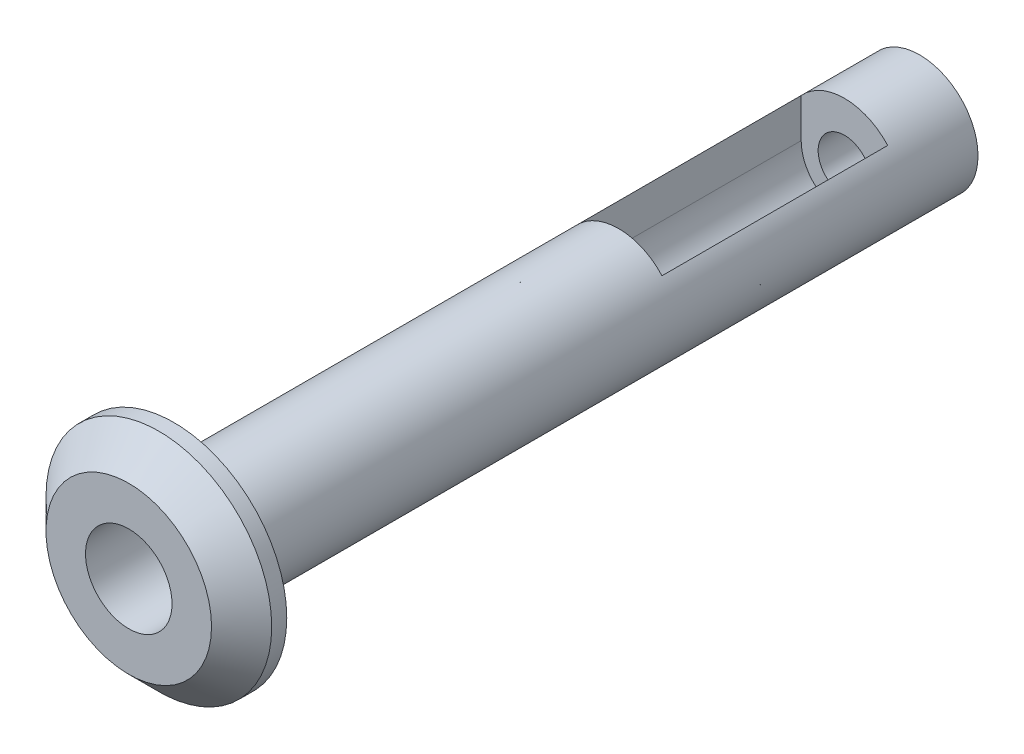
from build123d import *
from build123d.topology import SkipClean

# Parameters (mm, degrees)
CROQUIS1_R              = 7.5
CROQUIS1_R_2            = 1.75
SALIENTE_EXTRUIR1_DEPTH = 1.5
CHAFL_N1_SIZE           = 2
SALIENTE_EXTRUIR2_START = 49.56
CROQUIS2_R              = 3.875
CROQUIS2_R_2            = 1.75
SALIENTE_EXTRUIR2_DEPTH = 49.56
CROQUIS3_R              = 2.875
CORTAR_EXTRUIR1_DEPTH   = 47.56
CORTAR_EXTRUIR2_DEPTH   = 15


with BuildPart() as part:
    # Croquis1 → Saliente-Extruir1 (new, symmetric)
    with BuildSketch(Plane.XY):
        Circle(CROQUIS1_R)
        Circle(CROQUIS1_R_2, mode=Mode.SUBTRACT)
    extrude(amount=SALIENTE_EXTRUIR1_DEPTH, both=True)

    # Chafl_n1
    chafl_n1_edges = [part.edges().sort_by_distance(p)[0] for p in [
        (-7.5, 0, 1.5),
    ]]
    chamfer(chafl_n1_edges, length=CHAFL_N1_SIZE)

    # Croquis2 → Saliente-Extruir2 (add)
    with SkipClean():  # the faces are left unmerged after this step: merging them gives an invalid solid
        with BuildSketch(Plane(origin=(0, 0, -1.5), x_dir=(-1, 0, 0), z_dir=(0, 0, -1)).offset(SALIENTE_EXTRUIR2_START)):
            with Locations(Location((0, 0, 0), (0, 0, 180))):
                Circle(CROQUIS2_R)
            Circle(CROQUIS2_R_2, mode=Mode.SUBTRACT)
        extrude(amount=-SALIENTE_EXTRUIR2_DEPTH)

    # Croquis3 → Cortar-Extruir1 (cut)
    with BuildSketch(Plane.XY.offset(1.5)):
        Circle(CROQUIS3_R)
    extrude(amount=-CORTAR_EXTRUIR1_DEPTH, mode=Mode.SUBTRACT)

    # Croquis4 → Cortar-Extruir2 (cut)
    with BuildSketch(Plane.XY.offset(-46.06)):
        with BuildLine():
            Line((-2.875, 2.598076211), (-2.875, 0))
            Line((-2.875, 0), (2.875, 0))
            Line((2.875, 0), (2.875, 2.598076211))
            ThreePointArc((2.875, 2.598076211), (0, 3.875), (-2.875, 2.598076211))
        make_face()
    extrude(amount=CORTAR_EXTRUIR2_DEPTH, mode=Mode.SUBTRACT)


solid = part.part
